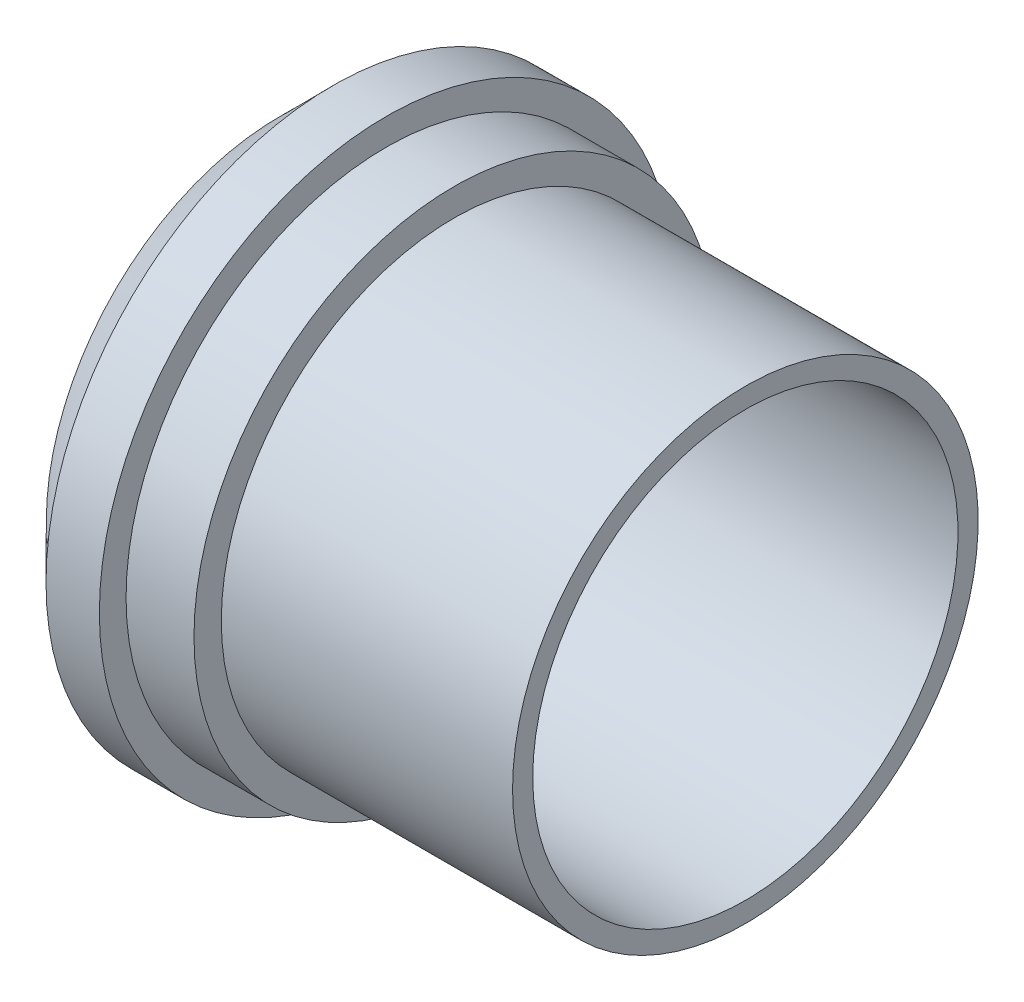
ISO-10303-21;
HEADER;
FILE_DESCRIPTION(('STEP AP214'),'2;1');
FILE_NAME('part.step','',(''),(''),'','','');
FILE_SCHEMA(('AUTOMOTIVE_DESIGN { 1 0 10303 214 1 1 1 1 }'));
ENDSEC;
DATA;
#1=APPLICATION_CONTEXT('core data for automotive mechanical design processes');
#2=APPLICATION_PROTOCOL_DEFINITION('international standard','automotive_design',2000,#1);
#3=PRODUCT_CONTEXT('',#1,'mechanical');
#4=PRODUCT('Part','Part','',(#3));
#5=PRODUCT_RELATED_PRODUCT_CATEGORY('part','',(#4));
#6=PRODUCT_DEFINITION_FORMATION('','',#4);
#7=PRODUCT_DEFINITION_CONTEXT('part definition',#1,'design');
#8=PRODUCT_DEFINITION('design','',#6,#7);
#9=PRODUCT_DEFINITION_SHAPE('','',#8);
#10=(LENGTH_UNIT() NAMED_UNIT(*) SI_UNIT(.MILLI.,.METRE.));
#11=(NAMED_UNIT(*) PLANE_ANGLE_UNIT() SI_UNIT($,.RADIAN.));
#12=(NAMED_UNIT(*) SI_UNIT($,.STERADIAN.) SOLID_ANGLE_UNIT());
#13=UNCERTAINTY_MEASURE_WITH_UNIT(LENGTH_MEASURE(1.E-05),#10,'distance_accuracy_value','');
#14=(GEOMETRIC_REPRESENTATION_CONTEXT(3) GLOBAL_UNCERTAINTY_ASSIGNED_CONTEXT((#13)) GLOBAL_UNIT_ASSIGNED_CONTEXT((#10,
#11,#12)) REPRESENTATION_CONTEXT('',''));
#15=CARTESIAN_POINT('',(0.,0.,0.));
#16=DIRECTION('',(0.,0.,1.));
#17=DIRECTION('',(1.,0.,0.));
#18=AXIS2_PLACEMENT_3D('',#15,#16,#17);
#19=CARTESIAN_POINT('',(0.,19.05,0.));
#20=DIRECTION('',(1.,0.,0.));
#21=DIRECTION('',(0.,0.,-1.));
#22=AXIS2_PLACEMENT_3D('',#19,#20,#21);
#23=PLANE('',#22);
#24=CARTESIAN_POINT('',(0.,19.05,0.));
#25=DIRECTION('',(-1.,0.,0.));
#26=DIRECTION('',(0.,0.,1.));
#27=AXIS2_PLACEMENT_3D('',#24,#25,#26);
#28=CIRCLE('',#27,17.399);
#29=CARTESIAN_POINT('',(0.,19.05,17.399));
#30=VERTEX_POINT('',#29);
#31=EDGE_CURVE('E58',#30,#30,#28,.T.);
#32=ORIENTED_EDGE('',*,*,#31,.T.);
#33=EDGE_LOOP('',(#32));
#34=FACE_BOUND('',#33,.T.);
#35=CARTESIAN_POINT('',(0.,19.05,0.));
#36=DIRECTION('',(-1.,0.,0.));
#37=DIRECTION('',(0.,0.,1.));
#38=AXIS2_PLACEMENT_3D('',#35,#36,#37);
#39=CIRCLE('',#38,19.05);
#40=CARTESIAN_POINT('',(0.,19.05,19.05));
#41=VERTEX_POINT('',#40);
#42=EDGE_CURVE('E10',#41,#41,#39,.T.);
#43=ORIENTED_EDGE('',*,*,#42,.F.);
#44=EDGE_LOOP('',(#43));
#45=FACE_BOUND('',#44,.T.);
#46=ADVANCED_FACE('F30',(#34,#45),#23,.T.);
#47=CARTESIAN_POINT('',(-38.1,19.05,0.));
#48=DIRECTION('',(-1.,0.,0.));
#49=DIRECTION('',(0.,0.,1.));
#50=AXIS2_PLACEMENT_3D('',#47,#48,#49);
#51=CYLINDRICAL_SURFACE('',#50,19.05);
#52=ORIENTED_EDGE('',*,*,#42,.T.);
#53=EDGE_LOOP('',(#52));
#54=FACE_BOUND('',#53,.T.);
#55=CARTESIAN_POINT('',(-23.83282,19.05,0.));
#56=DIRECTION('',(-1.,0.,0.));
#57=DIRECTION('',(0.,0.,1.));
#58=AXIS2_PLACEMENT_3D('',#55,#56,#57);
#59=CIRCLE('',#58,19.05);
#60=CARTESIAN_POINT('',(-23.83282,19.05,19.05));
#61=VERTEX_POINT('',#60);
#62=EDGE_CURVE('E36',#61,#61,#59,.T.);
#63=ORIENTED_EDGE('',*,*,#62,.F.);
#64=EDGE_LOOP('',(#63));
#65=FACE_BOUND('',#64,.T.);
#66=ADVANCED_FACE('F91',(#54,#65),#51,.T.);
#67=CARTESIAN_POINT('',(-23.83282,0.,0.));
#68=DIRECTION('',(1.,0.,0.));
#69=DIRECTION('',(0.,0.,-1.));
#70=AXIS2_PLACEMENT_3D('',#67,#68,#69);
#71=PLANE('',#70);
#72=ORIENTED_EDGE('',*,*,#62,.T.);
#73=EDGE_LOOP('',(#72));
#74=FACE_BOUND('',#73,.T.);
#75=CARTESIAN_POINT('',(-23.83282,19.05,0.));
#76=DIRECTION('',(-1.,0.,0.));
#77=DIRECTION('',(0.,0.,1.));
#78=AXIS2_PLACEMENT_3D('',#75,#76,#77);
#79=CIRCLE('',#78,21.2852);
#80=CARTESIAN_POINT('',(-23.83282,19.05,21.2852));
#81=VERTEX_POINT('',#80);
#82=EDGE_CURVE('E40',#81,#81,#79,.T.);
#83=ORIENTED_EDGE('',*,*,#82,.F.);
#84=EDGE_LOOP('',(#83));
#85=FACE_BOUND('',#84,.T.);
#86=ADVANCED_FACE('F95',(#74,#85),#71,.T.);
#87=CARTESIAN_POINT('',(-38.1,19.05,0.));
#88=DIRECTION('',(-1.,0.,0.));
#89=DIRECTION('',(0.,0.,1.));
#90=AXIS2_PLACEMENT_3D('',#87,#88,#89);
#91=CYLINDRICAL_SURFACE('',#90,21.2852);
#92=ORIENTED_EDGE('',*,*,#82,.T.);
#93=EDGE_LOOP('',(#92));
#94=FACE_BOUND('',#93,.T.);
#95=CARTESIAN_POINT('',(-29.39034,19.05,0.));
#96=DIRECTION('',(-1.,0.,0.));
#97=DIRECTION('',(0.,0.,1.));
#98=AXIS2_PLACEMENT_3D('',#95,#96,#97);
#99=CIRCLE('',#98,21.2852);
#100=CARTESIAN_POINT('',(-29.39034,19.05,21.2852));
#101=VERTEX_POINT('',#100);
#102=EDGE_CURVE('E44',#101,#101,#99,.T.);
#103=ORIENTED_EDGE('',*,*,#102,.F.);
#104=EDGE_LOOP('',(#103));
#105=FACE_BOUND('',#104,.T.);
#106=ADVANCED_FACE('F99',(#94,#105),#91,.T.);
#107=CARTESIAN_POINT('',(-29.39034,-2.2352,0.));
#108=DIRECTION('',(1.,0.,0.));
#109=DIRECTION('',(0.,0.,-1.));
#110=AXIS2_PLACEMENT_3D('',#107,#108,#109);
#111=PLANE('',#110);
#112=ORIENTED_EDGE('',*,*,#102,.T.);
#113=EDGE_LOOP('',(#112));
#114=FACE_BOUND('',#113,.T.);
#115=CARTESIAN_POINT('',(-29.39034,19.05,0.));
#116=DIRECTION('',(-1.,0.,0.));
#117=DIRECTION('',(0.,0.,1.));
#118=AXIS2_PLACEMENT_3D('',#115,#116,#117);
#119=CIRCLE('',#118,23.4696);
#120=CARTESIAN_POINT('',(-29.39034,19.05,23.4696));
#121=VERTEX_POINT('',#120);
#122=EDGE_CURVE('E49',#121,#121,#119,.T.);
#123=ORIENTED_EDGE('',*,*,#122,.F.);
#124=EDGE_LOOP('',(#123));
#125=FACE_BOUND('',#124,.T.);
#126=ADVANCED_FACE('F87',(#114,#125),#111,.T.);
#127=CARTESIAN_POINT('',(-38.1,19.05,0.));
#128=DIRECTION('',(-1.,0.,0.));
#129=DIRECTION('',(0.,0.,1.));
#130=AXIS2_PLACEMENT_3D('',#127,#128,#129);
#131=CYLINDRICAL_SURFACE('',#130,23.4696);
#132=ORIENTED_EDGE('',*,*,#122,.T.);
#133=EDGE_LOOP('',(#132));
#134=FACE_BOUND('',#133,.T.);
#135=CARTESIAN_POINT('',(-33.7566,19.05,0.));
#136=DIRECTION('',(-1.,0.,0.));
#137=DIRECTION('',(0.,0.,1.));
#138=AXIS2_PLACEMENT_3D('',#135,#136,#137);
#139=CIRCLE('',#138,23.4696);
#140=CARTESIAN_POINT('',(-33.7566,19.05,23.4696));
#141=VERTEX_POINT('',#140);
#142=EDGE_CURVE('E52',#141,#141,#139,.T.);
#143=ORIENTED_EDGE('',*,*,#142,.F.);
#144=EDGE_LOOP('',(#143));
#145=FACE_BOUND('',#144,.T.);
#146=ADVANCED_FACE('F81',(#134,#145),#131,.T.);
#147=CARTESIAN_POINT('',(-38.1,19.05,0.));
#148=DIRECTION('',(1.,0.,0.));
#149=DIRECTION('',(0.,0.,-1.));
#150=AXIS2_PLACEMENT_3D('',#147,#148,#149);
#151=CONICAL_SURFACE('',#150,19.1008,0.788313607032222);
#152=ORIENTED_EDGE('',*,*,#142,.T.);
#153=EDGE_LOOP('',(#152));
#154=FACE_BOUND('',#153,.T.);
#155=CARTESIAN_POINT('',(-38.1,19.05,0.));
#156=DIRECTION('',(-1.,0.,0.));
#157=DIRECTION('',(0.,0.,1.));
#158=AXIS2_PLACEMENT_3D('',#155,#156,#157);
#159=CIRCLE('',#158,19.1008);
#160=CARTESIAN_POINT('',(-38.1,19.05,19.1008));
#161=VERTEX_POINT('',#160);
#162=EDGE_CURVE('E55',#161,#161,#159,.T.);
#163=ORIENTED_EDGE('',*,*,#162,.F.);
#164=EDGE_LOOP('',(#163));
#165=FACE_BOUND('',#164,.T.);
#166=ADVANCED_FACE('F76',(#154,#165),#151,.T.);
#167=CARTESIAN_POINT('',(-38.1,-0.0508000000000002,0.));
#168=DIRECTION('',(-1.,0.,0.));
#169=DIRECTION('',(0.,0.,1.));
#170=AXIS2_PLACEMENT_3D('',#167,#168,#169);
#171=PLANE('',#170);
#172=CARTESIAN_POINT('',(-38.1,19.05,0.));
#173=DIRECTION('',(-1.,0.,0.));
#174=DIRECTION('',(0.,0.,1.));
#175=AXIS2_PLACEMENT_3D('',#172,#173,#174);
#176=CIRCLE('',#175,17.399);
#177=CARTESIAN_POINT('',(-38.1,19.05,17.399));
#178=VERTEX_POINT('',#177);
#179=EDGE_CURVE('E59',#178,#178,#176,.T.);
#180=ORIENTED_EDGE('',*,*,#179,.F.);
#181=EDGE_LOOP('',(#180));
#182=FACE_BOUND('',#181,.T.);
#183=ORIENTED_EDGE('',*,*,#162,.T.);
#184=EDGE_LOOP('',(#183));
#185=FACE_BOUND('',#184,.T.);
#186=ADVANCED_FACE('F70',(#182,#185),#171,.T.);
#187=CARTESIAN_POINT('',(0.,19.05,0.));
#188=DIRECTION('',(-1.,0.,0.));
#189=DIRECTION('',(0.,0.,1.));
#190=AXIS2_PLACEMENT_3D('',#187,#188,#189);
#191=CYLINDRICAL_SURFACE('',#190,17.399);
#192=CARTESIAN_POINT('',(0.,19.05,17.399));
#193=CARTESIAN_POINT('',(-0.396875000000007,19.05,17.399));
#194=CARTESIAN_POINT('',(-0.793750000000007,19.05,17.399));
#195=CARTESIAN_POINT('',(-1.58750000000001,19.05,17.399));
#196=CARTESIAN_POINT('',(-1.98437500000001,19.05,17.399));
#197=CARTESIAN_POINT('',(-2.77812500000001,19.05,17.399));
#198=CARTESIAN_POINT('',(-3.17500000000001,19.05,17.399));
#199=CARTESIAN_POINT('',(-3.96875000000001,19.05,17.399));
#200=CARTESIAN_POINT('',(-4.36562500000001,19.05,17.399));
#201=CARTESIAN_POINT('',(-5.15937500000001,19.05,17.399));
#202=CARTESIAN_POINT('',(-5.55625000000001,19.05,17.399));
#203=CARTESIAN_POINT('',(-6.35000000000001,19.05,17.399));
#204=CARTESIAN_POINT('',(-6.74687500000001,19.05,17.399));
#205=CARTESIAN_POINT('',(-7.54062500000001,19.05,17.399));
#206=CARTESIAN_POINT('',(-7.93750000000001,19.05,17.399));
#207=CARTESIAN_POINT('',(-8.73125000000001,19.05,17.399));
#208=CARTESIAN_POINT('',(-9.12812500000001,19.05,17.399));
#209=CARTESIAN_POINT('',(-9.92187500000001,19.05,17.399));
#210=CARTESIAN_POINT('',(-10.31875,19.05,17.399));
#211=CARTESIAN_POINT('',(-11.1125,19.05,17.399));
#212=CARTESIAN_POINT('',(-11.509375,19.05,17.399));
#213=CARTESIAN_POINT('',(-12.303125,19.05,17.399));
#214=CARTESIAN_POINT('',(-12.7,19.05,17.399));
#215=CARTESIAN_POINT('',(-13.49375,19.05,17.399));
#216=CARTESIAN_POINT('',(-13.890625,19.05,17.399));
#217=CARTESIAN_POINT('',(-14.684375,19.05,17.399));
#218=CARTESIAN_POINT('',(-15.08125,19.05,17.399));
#219=CARTESIAN_POINT('',(-15.875,19.05,17.399));
#220=CARTESIAN_POINT('',(-16.271875,19.05,17.399));
#221=CARTESIAN_POINT('',(-17.065625,19.05,17.399));
#222=CARTESIAN_POINT('',(-17.4625,19.05,17.399));
#223=CARTESIAN_POINT('',(-18.25625,19.05,17.399));
#224=CARTESIAN_POINT('',(-18.653125,19.05,17.399));
#225=CARTESIAN_POINT('',(-19.446875,19.05,17.399));
#226=CARTESIAN_POINT('',(-19.84375,19.05,17.399));
#227=CARTESIAN_POINT('',(-20.6375,19.05,17.399));
#228=CARTESIAN_POINT('',(-21.034375,19.05,17.399));
#229=CARTESIAN_POINT('',(-21.828125,19.05,17.399));
#230=CARTESIAN_POINT('',(-22.225,19.05,17.399));
#231=CARTESIAN_POINT('',(-23.01875,19.05,17.399));
#232=CARTESIAN_POINT('',(-23.415625,19.05,17.399));
#233=CARTESIAN_POINT('',(-24.209375,19.05,17.399));
#234=CARTESIAN_POINT('',(-24.60625,19.05,17.399));
#235=CARTESIAN_POINT('',(-25.4,19.05,17.399));
#236=CARTESIAN_POINT('',(-25.796875,19.05,17.399));
#237=CARTESIAN_POINT('',(-26.590625,19.05,17.399));
#238=CARTESIAN_POINT('',(-26.9875,19.05,17.399));
#239=CARTESIAN_POINT('',(-27.78125,19.05,17.399));
#240=CARTESIAN_POINT('',(-28.178125,19.05,17.399));
#241=CARTESIAN_POINT('',(-28.971875,19.05,17.399));
#242=CARTESIAN_POINT('',(-29.36875,19.05,17.399));
#243=CARTESIAN_POINT('',(-30.1625,19.05,17.399));
#244=CARTESIAN_POINT('',(-30.559375,19.05,17.399));
#245=CARTESIAN_POINT('',(-31.353125,19.05,17.399));
#246=CARTESIAN_POINT('',(-31.75,19.05,17.399));
#247=CARTESIAN_POINT('',(-32.54375,19.05,17.399));
#248=CARTESIAN_POINT('',(-32.940625,19.05,17.399));
#249=CARTESIAN_POINT('',(-33.734375,19.05,17.399));
#250=CARTESIAN_POINT('',(-34.13125,19.05,17.399));
#251=CARTESIAN_POINT('',(-34.925,19.05,17.399));
#252=CARTESIAN_POINT('',(-35.321875,19.05,17.399));
#253=CARTESIAN_POINT('',(-36.115625,19.05,17.399));
#254=CARTESIAN_POINT('',(-36.5125,19.05,17.399));
#255=CARTESIAN_POINT('',(-37.30625,19.05,17.399));
#256=CARTESIAN_POINT('',(-37.703125,19.05,17.399));
#257=CARTESIAN_POINT('',(-38.1,19.05,17.399));
#258=B_SPLINE_CURVE_WITH_KNOTS('',3,(#192,#193,#194,#195,#196,#197,#198,#199,#200,#201,#202,
#203,#204,#205,#206,#207,#208,#209,#210,#211,#212,#213,#214,#215,#216,#217,#218,#219,#220,#221,
#222,#223,#224,#225,#226,#227,#228,#229,#230,#231,#232,#233,#234,#235,#236,#237,#238,#239,#240,
#241,#242,#243,#244,#245,#246,#247,#248,#249,#250,#251,#252,#253,#254,#255,#256,#257),
.UNSPECIFIED.,.F.,.F.,(4,2,2,2,2,2,2,2,2,2,2,2,2,2,2,2,2,2,2,2,2,2,2,2,2,2,2,2,2,2,2,2,4),(0.,
1.190625,2.38125,3.571875,4.7625,5.953125,7.14375,8.334375,9.525,10.715625,11.90625,13.096875,
14.2875,15.478125,16.66875,17.859375,19.05,20.240625,21.43125,22.621875,23.8125,25.003125,
26.19375,27.384375,28.575,29.765625,30.95625,32.146875,33.3375,34.528125,35.71875,36.909375,
38.1),.UNSPECIFIED.);
#259=EDGE_CURVE('BSEAM67',#30,#178,#258,.T.);
#260=ORIENTED_EDGE('',*,*,#31,.F.);
#261=ORIENTED_EDGE('',*,*,#179,.T.);
#262=ORIENTED_EDGE('',*,*,#259,.T.);
#263=ORIENTED_EDGE('',*,*,#259,.F.);
#264=EDGE_LOOP('',(#260,#262,#261,#263));
#265=FACE_BOUND('',#264,.T.);
#266=ADVANCED_FACE('F67',(#265),#191,.F.);
#267=CLOSED_SHELL('',(#46,#66,#86,#106,#126,#146,#166,#186,#266));
#268=MANIFOLD_SOLID_BREP('B2',#267);
#269=ADVANCED_BREP_SHAPE_REPRESENTATION('',(#18,#268),#14);
#270=SHAPE_DEFINITION_REPRESENTATION(#9,#269);
ENDSEC;
END-ISO-10303-21;
